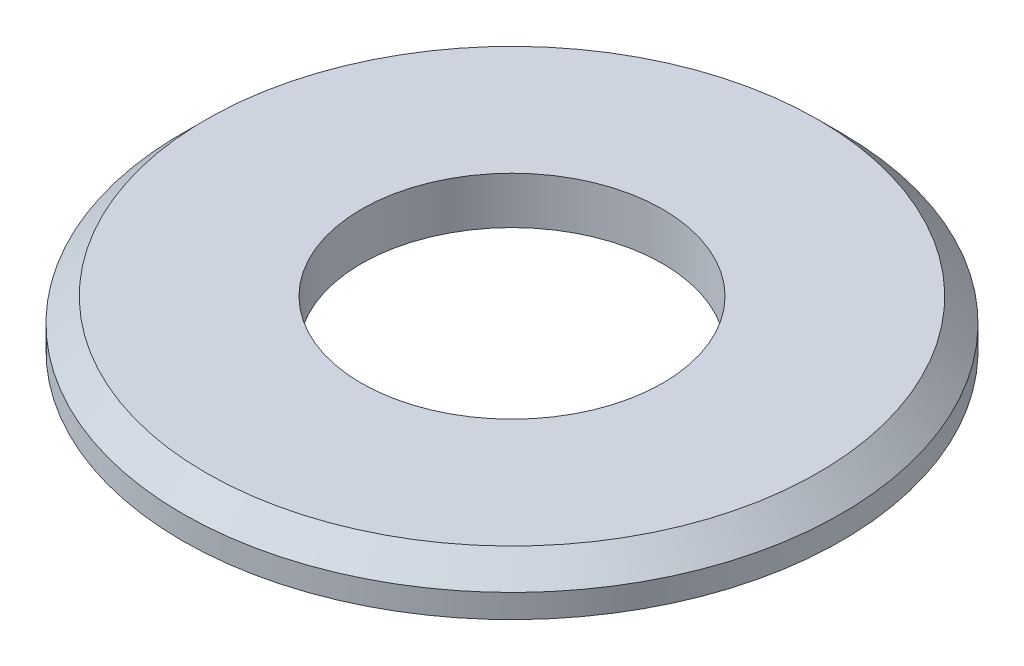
from build123d import *

# Parameters (mm, degrees)
SKETCH1_R      = 3.5
SKETCH1_R_2    = 1.6
EXTRUDE1_DEPTH = 0.5
CHAMFER1_SIZE  = 0.25


with BuildPart() as part:
    # Sketch1 → Extrude1 (new body)
    with BuildSketch(Plane(origin=(0, 0, 0), x_dir=(1, 0, 0), z_dir=(0, 1, 0))):
        with Locations(Location((0, 0, 0), (0, 0, 270))):
            Circle(SKETCH1_R)
        with Locations(Location((0, 0, 0), (0, 0, 270))):
            Circle(SKETCH1_R_2, mode=Mode.SUBTRACT)
    extrude(amount=EXTRUDE1_DEPTH)

    # Chamfer1
    chamfer1_edges = [part.edges().sort_by_distance(p)[0] for p in [
        (0, 0.5, -3.5),
    ]]
    chamfer(chamfer1_edges, length=CHAMFER1_SIZE)


solid = part.part
